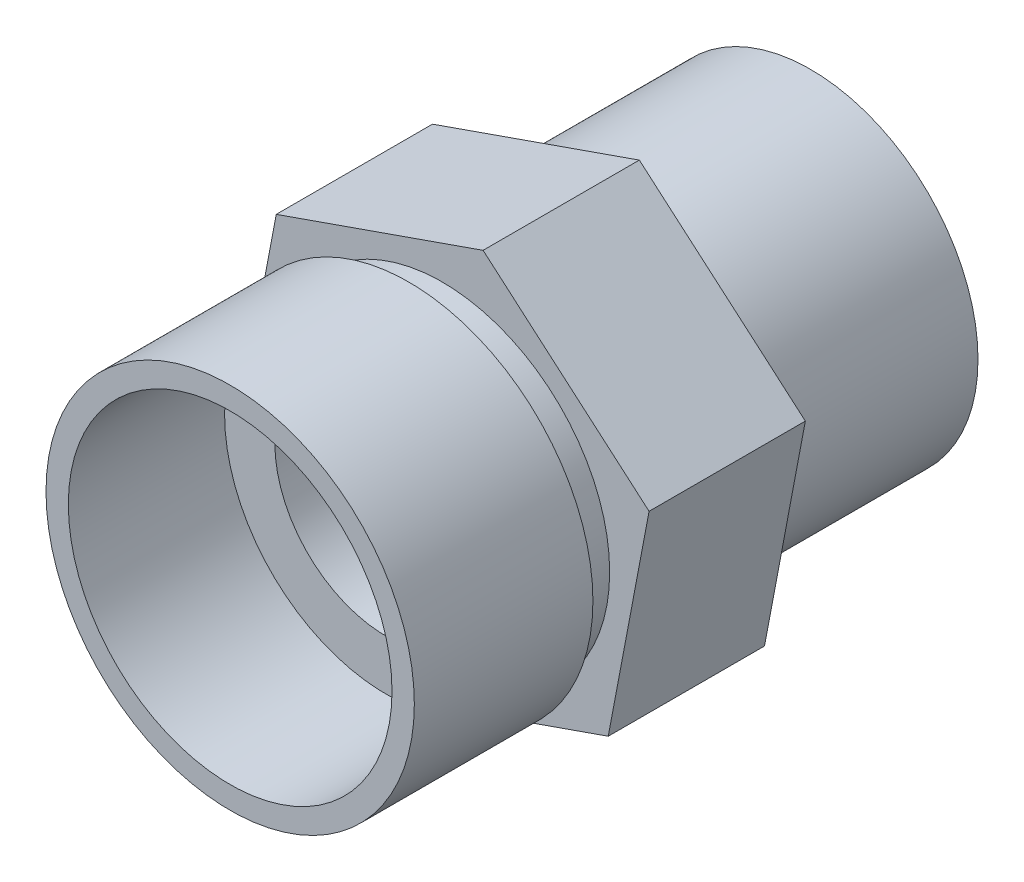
from build123d import *

# Parameters (mm, degrees)
ESQUISSE1_R             = 7.5
BOSS_EXTRU_1_DEPTH      = 9.5
BOSS_EXTRU_2_DEPTH      = 7
ESQUISSE3_R             = 7.5
BOSS_EXTRU_3_DEPTH      = 1.5
ESQUISSE4_R             = 8.25
BOSS_EXTRU_4_DEPTH      = 1
ESQUISSE5_R             = 5
ENL_V_MAT_EXTRU_1_DEPTH = 24.234469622
ESQUISSE6_R             = 8.25
ESQUISSE6_R_2           = 7.25
BOSS_EXTRU_5_DEPTH      = 7


with BuildPart() as part:
    # Esquisse1 → Boss.-Extru.1 (new body)
    with BuildSketch(Plane.XY):
        Circle(ESQUISSE1_R)
    extrude(amount=BOSS_EXTRU_1_DEPTH)

    # Esquisse2 → Boss.-Extru.2 (add)
    with BuildSketch(Plane.XY.offset(9.5)):
        Polygon((7.436372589, -6.405754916), (9.265732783, 3.237210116), (1.829360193, 9.642965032), (-7.436372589, 6.405754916), (-9.265732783, -3.237210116), (-1.829360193, -9.642965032), align=None)
    extrude(amount=BOSS_EXTRU_2_DEPTH)

    # Esquisse3 → Boss.-Extru.3 (add)
    with BuildSketch(Plane.XY.offset(16.5)):
        Circle(ESQUISSE3_R)
    extrude(amount=BOSS_EXTRU_3_DEPTH)

    # Esquisse4 → Boss.-Extru.4 (add)
    with BuildSketch(Plane.XY.offset(18)):
        Circle(ESQUISSE4_R)
    extrude(amount=BOSS_EXTRU_4_DEPTH)

    # Esquisse5 → Enl_v. mat.-Extru.1 (cut, through all)
    with BuildSketch(Plane.XY.offset(19)):
        Circle(ESQUISSE5_R)
    extrude(amount=-ENL_V_MAT_EXTRU_1_DEPTH, mode=Mode.SUBTRACT)

    # Esquisse6 → Boss.-Extru.5 (add)
    with BuildSketch(Plane.XY.offset(19)):
        Circle(ESQUISSE6_R)
        Circle(ESQUISSE6_R_2, mode=Mode.SUBTRACT)
    extrude(amount=BOSS_EXTRU_5_DEPTH)


solid = part.part
